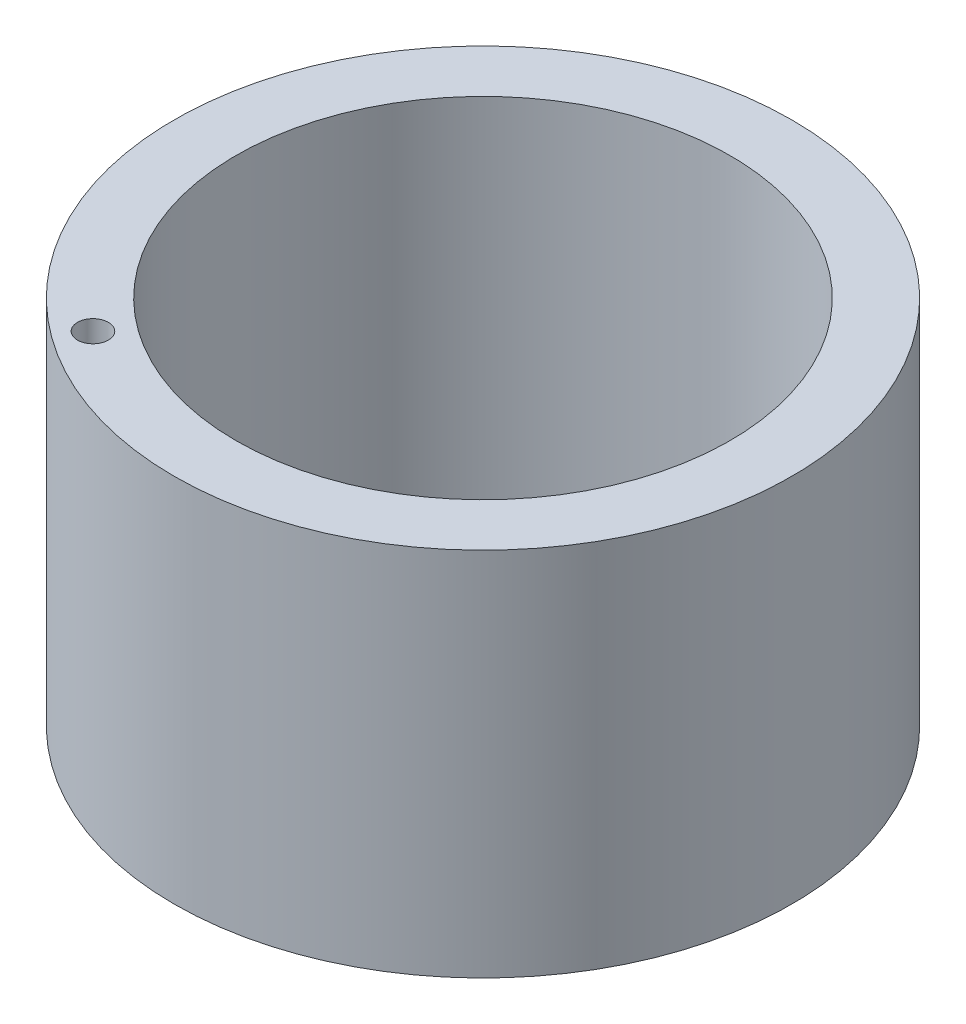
from build123d import *

# Parameters (mm, degrees)
SKETCH1_R                 = 25
SKETCH1_R_2               = 20
BOSS_EXTRUDE1_DEPTH       = 30
F_2_5MM_DOWEL_HOLE1_D     = 2.5
F_2_5MM_DOWEL_HOLE1_DEPTH = 25
F_2_5MM_DOWEL_HOLE1_TIP   = 0.751075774


with BuildPart() as part:
    # Sketch1 → Boss-Extrude1 (new body)
    with BuildSketch(Plane(origin=(0, 0, 0), x_dir=(1, 0, 0), z_dir=(0, 1, 0))):
        with Locations(Location((0, 0, 0), (0, 0, 270))):
            Circle(SKETCH1_R)
        with Locations(Location((0, 0, 0), (0, 0, 270))):
            Circle(SKETCH1_R_2, mode=Mode.SUBTRACT)
    extrude(amount=BOSS_EXTRUDE1_DEPTH)

    # 2.5mm Dowel Hole1
    with Locations(Plane(origin=(0, 30, 0), x_dir=(1, 0, 0), z_dir=(0, 1, 0))):
        with Locations((-13.466276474, -18.114876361)):
            Hole(F_2_5MM_DOWEL_HOLE1_D / 2, depth=F_2_5MM_DOWEL_HOLE1_DEPTH)
            with Locations((0, 0, -(F_2_5MM_DOWEL_HOLE1_DEPTH + F_2_5MM_DOWEL_HOLE1_TIP / 2))):  # 118° drill point
                Cone(0, F_2_5MM_DOWEL_HOLE1_D / 2, F_2_5MM_DOWEL_HOLE1_TIP, mode=Mode.SUBTRACT)


solid = part.part
